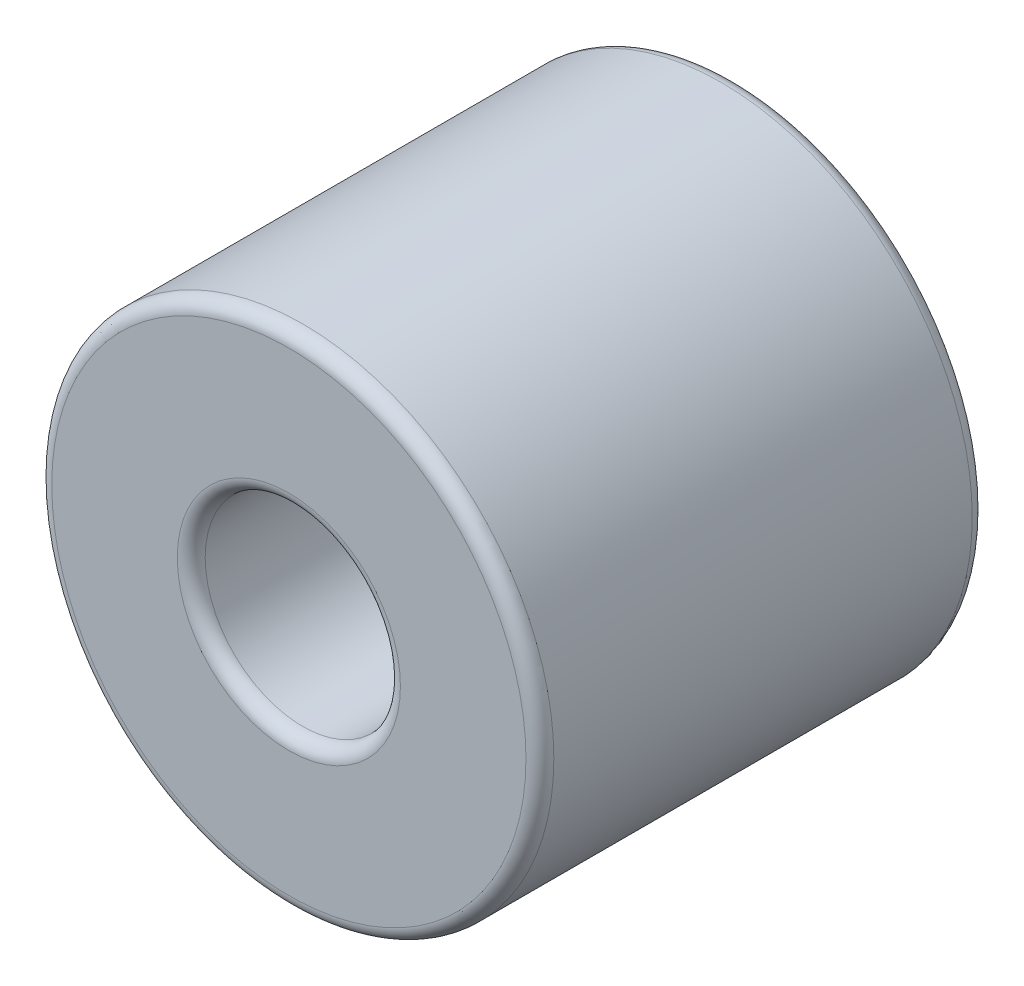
ISO-10303-21;
HEADER;
FILE_DESCRIPTION(('STEP AP214'),'2;1');
FILE_NAME('part.step','',(''),(''),'','','');
FILE_SCHEMA(('AUTOMOTIVE_DESIGN { 1 0 10303 214 1 1 1 1 }'));
ENDSEC;
DATA;
#1=APPLICATION_CONTEXT('core data for automotive mechanical design processes');
#2=APPLICATION_PROTOCOL_DEFINITION('international standard','automotive_design',2000,#1);
#3=PRODUCT_CONTEXT('',#1,'mechanical');
#4=PRODUCT('Part','Part','',(#3));
#5=PRODUCT_RELATED_PRODUCT_CATEGORY('part','',(#4));
#6=PRODUCT_DEFINITION_FORMATION('','',#4);
#7=PRODUCT_DEFINITION_CONTEXT('part definition',#1,'design');
#8=PRODUCT_DEFINITION('design','',#6,#7);
#9=PRODUCT_DEFINITION_SHAPE('','',#8);
#10=(LENGTH_UNIT() NAMED_UNIT(*) SI_UNIT(.MILLI.,.METRE.));
#11=(NAMED_UNIT(*) PLANE_ANGLE_UNIT() SI_UNIT($,.RADIAN.));
#12=(NAMED_UNIT(*) SI_UNIT($,.STERADIAN.) SOLID_ANGLE_UNIT());
#13=UNCERTAINTY_MEASURE_WITH_UNIT(LENGTH_MEASURE(1.E-05),#10,'distance_accuracy_value','');
#14=(GEOMETRIC_REPRESENTATION_CONTEXT(3) GLOBAL_UNCERTAINTY_ASSIGNED_CONTEXT((#13)) GLOBAL_UNIT_ASSIGNED_CONTEXT((#10,
#11,#12)) REPRESENTATION_CONTEXT('',''));
#15=CARTESIAN_POINT('',(0.,0.,0.));
#16=DIRECTION('',(0.,0.,1.));
#17=DIRECTION('',(1.,0.,0.));
#18=AXIS2_PLACEMENT_3D('',#15,#16,#17);
#19=CARTESIAN_POINT('',(0.,4.5,4.));
#20=DIRECTION('',(0.,0.,-1.));
#21=DIRECTION('',(-1.,0.,0.));
#22=AXIS2_PLACEMENT_3D('',#19,#20,#21);
#23=PLANE('',#22);
#24=CARTESIAN_POINT('',(0.,0.,4.));
#25=DIRECTION('',(0.,0.,-1.));
#26=DIRECTION('',(-1.,0.,0.));
#27=AXIS2_PLACEMENT_3D('',#24,#25,#26);
#28=CIRCLE('',#27,2.);
#29=CARTESIAN_POINT('',(-2.,0.,4.));
#30=VERTEX_POINT('',#29);
#31=EDGE_CURVE('E48',#30,#30,#28,.T.);
#32=ORIENTED_EDGE('',*,*,#31,.T.);
#33=EDGE_LOOP('',(#32));
#34=FACE_BOUND('',#33,.T.);
#35=CARTESIAN_POINT('',(0.,0.,4.));
#36=DIRECTION('',(0.,0.,-1.));
#37=DIRECTION('',(-1.,0.,0.));
#38=AXIS2_PLACEMENT_3D('',#35,#36,#37);
#39=CIRCLE('',#38,4.25);
#40=CARTESIAN_POINT('',(-4.25,0.,4.));
#41=VERTEX_POINT('',#40);
#42=EDGE_CURVE('E51',#41,#41,#39,.F.);
#43=ORIENTED_EDGE('',*,*,#42,.T.);
#44=EDGE_LOOP('',(#43));
#45=FACE_BOUND('',#44,.T.);
#46=ADVANCED_FACE('F28',(#34,#45),#23,.F.);
#47=CARTESIAN_POINT('',(0.,0.,4.));
#48=DIRECTION('',(0.,0.,1.));
#49=DIRECTION('',(1.,0.,0.));
#50=AXIS2_PLACEMENT_3D('',#47,#48,#49);
#51=CYLINDRICAL_SURFACE('',#50,1.75);
#52=CARTESIAN_POINT('',(0.,0.,3.75));
#53=DIRECTION('',(0.,0.,-1.));
#54=DIRECTION('',(-1.,0.,0.));
#55=AXIS2_PLACEMENT_3D('',#52,#53,#54);
#56=CIRCLE('',#55,1.75);
#57=CARTESIAN_POINT('',(-1.75,0.,3.75));
#58=VERTEX_POINT('',#57);
#59=EDGE_CURVE('E54',#58,#58,#56,.F.);
#60=ORIENTED_EDGE('',*,*,#59,.T.);
#61=EDGE_LOOP('',(#60));
#62=FACE_BOUND('',#61,.T.);
#63=CARTESIAN_POINT('',(0.,0.,-3.75));
#64=DIRECTION('',(0.,0.,1.));
#65=DIRECTION('',(1.,0.,0.));
#66=AXIS2_PLACEMENT_3D('',#63,#64,#65);
#67=CIRCLE('',#66,1.75);
#68=CARTESIAN_POINT('',(1.75,0.,-3.75));
#69=VERTEX_POINT('',#68);
#70=EDGE_CURVE('E57',#69,#69,#67,.F.);
#71=ORIENTED_EDGE('',*,*,#70,.T.);
#72=EDGE_LOOP('',(#71));
#73=FACE_BOUND('',#72,.T.);
#74=ADVANCED_FACE('F61',(#62,#73),#51,.F.);
#75=CARTESIAN_POINT('',(0.,1.75,-4.));
#76=DIRECTION('',(0.,0.,1.));
#77=DIRECTION('',(1.,0.,0.));
#78=AXIS2_PLACEMENT_3D('',#75,#76,#77);
#79=PLANE('',#78);
#80=CARTESIAN_POINT('',(0.,0.,-4.));
#81=DIRECTION('',(0.,0.,1.));
#82=DIRECTION('',(1.,0.,0.));
#83=AXIS2_PLACEMENT_3D('',#80,#81,#82);
#84=CIRCLE('',#83,2.);
#85=CARTESIAN_POINT('',(2.,0.,-4.));
#86=VERTEX_POINT('',#85);
#87=EDGE_CURVE('E39',#86,#86,#84,.T.);
#88=ORIENTED_EDGE('',*,*,#87,.T.);
#89=EDGE_LOOP('',(#88));
#90=FACE_BOUND('',#89,.T.);
#91=CARTESIAN_POINT('',(0.,0.,-4.));
#92=DIRECTION('',(0.,0.,1.));
#93=DIRECTION('',(1.,0.,0.));
#94=AXIS2_PLACEMENT_3D('',#91,#92,#93);
#95=CIRCLE('',#94,4.25);
#96=CARTESIAN_POINT('',(4.25,0.,-4.));
#97=VERTEX_POINT('',#96);
#98=EDGE_CURVE('E43',#97,#97,#95,.F.);
#99=ORIENTED_EDGE('',*,*,#98,.T.);
#100=EDGE_LOOP('',(#99));
#101=FACE_BOUND('',#100,.T.);
#102=ADVANCED_FACE('F71',(#90,#101),#79,.F.);
#103=CARTESIAN_POINT('',(0.,0.,4.));
#104=DIRECTION('',(0.,0.,1.));
#105=DIRECTION('',(1.,0.,0.));
#106=AXIS2_PLACEMENT_3D('',#103,#104,#105);
#107=CYLINDRICAL_SURFACE('',#106,4.5);
#108=CARTESIAN_POINT('',(0.,0.,-3.75));
#109=DIRECTION('',(0.,0.,1.));
#110=DIRECTION('',(1.,0.,0.));
#111=AXIS2_PLACEMENT_3D('',#108,#109,#110);
#112=CIRCLE('',#111,4.5);
#113=CARTESIAN_POINT('',(4.5,0.,-3.75));
#114=VERTEX_POINT('',#113);
#115=EDGE_CURVE('E10',#114,#114,#112,.T.);
#116=ORIENTED_EDGE('',*,*,#115,.T.);
#117=EDGE_LOOP('',(#116));
#118=FACE_BOUND('',#117,.T.);
#119=CARTESIAN_POINT('',(0.,0.,3.75));
#120=DIRECTION('',(0.,0.,-1.));
#121=DIRECTION('',(-1.,0.,0.));
#122=AXIS2_PLACEMENT_3D('',#119,#120,#121);
#123=CIRCLE('',#122,4.5);
#124=CARTESIAN_POINT('',(-4.5,0.,3.75));
#125=VERTEX_POINT('',#124);
#126=EDGE_CURVE('E35',#125,#125,#123,.T.);
#127=ORIENTED_EDGE('',*,*,#126,.T.);
#128=EDGE_LOOP('',(#127));
#129=FACE_BOUND('',#128,.T.);
#130=ADVANCED_FACE('F74',(#118,#129),#107,.T.);
#131=CARTESIAN_POINT('',(0.,0.,3.75));
#132=DIRECTION('',(0.,0.,-1.));
#133=DIRECTION('',(-1.,0.,0.));
#134=AXIS2_PLACEMENT_3D('',#131,#132,#133);
#135=TOROIDAL_SURFACE('',#134,2.,0.25);
#136=ORIENTED_EDGE('',*,*,#31,.F.);
#137=EDGE_LOOP('',(#136));
#138=FACE_BOUND('',#137,.T.);
#139=ORIENTED_EDGE('',*,*,#59,.F.);
#140=EDGE_LOOP('',(#139));
#141=FACE_BOUND('',#140,.T.);
#142=ADVANCED_FACE('F67',(#138,#141),#135,.T.);
#143=CARTESIAN_POINT('',(0.,0.,-3.75));
#144=DIRECTION('',(0.,0.,1.));
#145=DIRECTION('',(1.,0.,0.));
#146=AXIS2_PLACEMENT_3D('',#143,#144,#145);
#147=TOROIDAL_SURFACE('',#146,2.,0.25);
#148=ORIENTED_EDGE('',*,*,#70,.F.);
#149=EDGE_LOOP('',(#148));
#150=FACE_BOUND('',#149,.T.);
#151=ORIENTED_EDGE('',*,*,#87,.F.);
#152=EDGE_LOOP('',(#151));
#153=FACE_BOUND('',#152,.T.);
#154=ADVANCED_FACE('F63',(#150,#153),#147,.T.);
#155=CARTESIAN_POINT('',(0.,0.,-3.75));
#156=DIRECTION('',(0.,0.,1.));
#157=DIRECTION('',(1.,0.,0.));
#158=AXIS2_PLACEMENT_3D('',#155,#156,#157);
#159=TOROIDAL_SURFACE('',#158,4.25,0.25);
#160=ORIENTED_EDGE('',*,*,#98,.F.);
#161=EDGE_LOOP('',(#160));
#162=FACE_BOUND('',#161,.T.);
#163=ORIENTED_EDGE('',*,*,#115,.F.);
#164=EDGE_LOOP('',(#163));
#165=FACE_BOUND('',#164,.T.);
#166=ADVANCED_FACE('F66',(#162,#165),#159,.T.);
#167=CARTESIAN_POINT('',(0.,0.,3.75));
#168=DIRECTION('',(0.,0.,-1.));
#169=DIRECTION('',(-1.,0.,0.));
#170=AXIS2_PLACEMENT_3D('',#167,#168,#169);
#171=TOROIDAL_SURFACE('',#170,4.25,0.25);
#172=ORIENTED_EDGE('',*,*,#126,.F.);
#173=EDGE_LOOP('',(#172));
#174=FACE_BOUND('',#173,.T.);
#175=ORIENTED_EDGE('',*,*,#42,.F.);
#176=EDGE_LOOP('',(#175));
#177=FACE_BOUND('',#176,.T.);
#178=ADVANCED_FACE('F30',(#174,#177),#171,.T.);
#179=CLOSED_SHELL('',(#46,#74,#102,#130,#142,#154,#166,#178));
#180=MANIFOLD_SOLID_BREP('B2',#179);
#181=ADVANCED_BREP_SHAPE_REPRESENTATION('',(#18,#180),#14);
#182=SHAPE_DEFINITION_REPRESENTATION(#9,#181);
ENDSEC;
END-ISO-10303-21;
